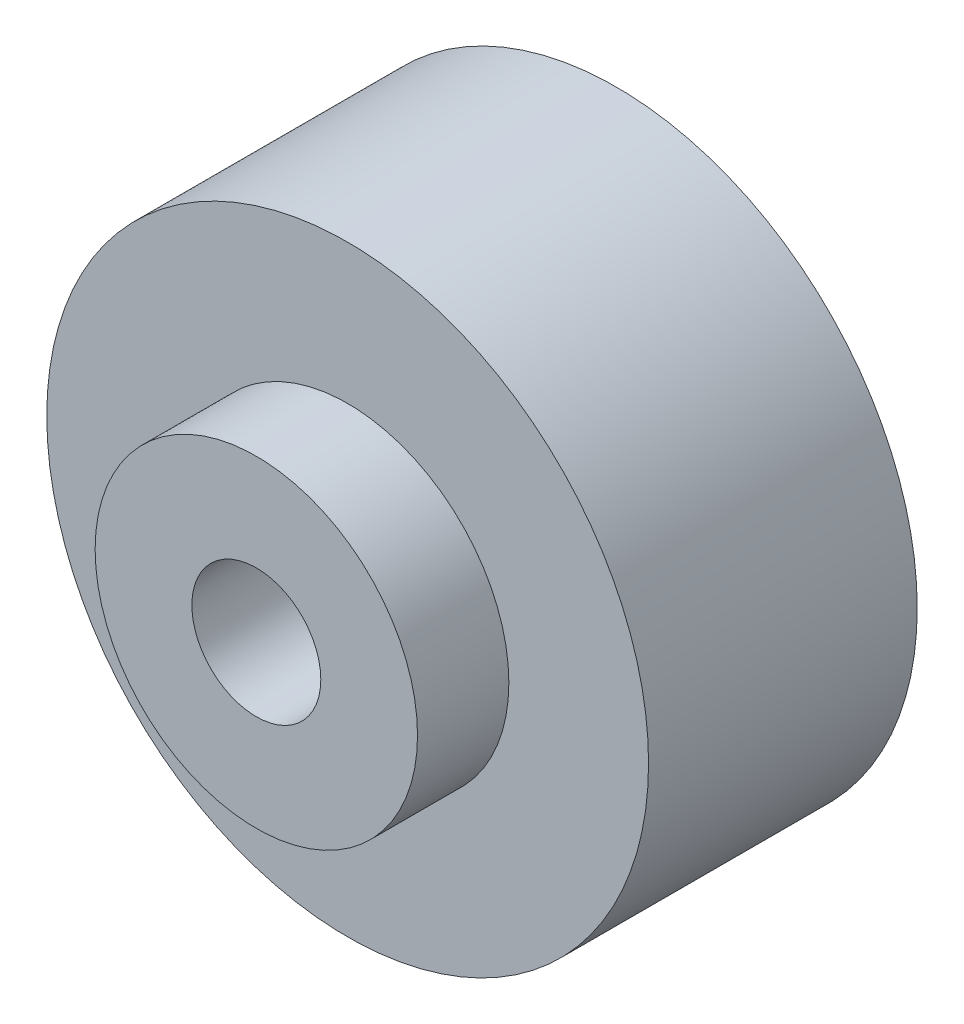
ISO-10303-21;
HEADER;
FILE_DESCRIPTION(('STEP AP214'),'2;1');
FILE_NAME('part.step','',(''),(''),'','','');
FILE_SCHEMA(('AUTOMOTIVE_DESIGN { 1 0 10303 214 1 1 1 1 }'));
ENDSEC;
DATA;
#1=APPLICATION_CONTEXT('core data for automotive mechanical design processes');
#2=APPLICATION_PROTOCOL_DEFINITION('international standard','automotive_design',2000,#1);
#3=PRODUCT_CONTEXT('',#1,'mechanical');
#4=PRODUCT('Part','Part','',(#3));
#5=PRODUCT_RELATED_PRODUCT_CATEGORY('part','',(#4));
#6=PRODUCT_DEFINITION_FORMATION('','',#4);
#7=PRODUCT_DEFINITION_CONTEXT('part definition',#1,'design');
#8=PRODUCT_DEFINITION('design','',#6,#7);
#9=PRODUCT_DEFINITION_SHAPE('','',#8);
#10=(LENGTH_UNIT() NAMED_UNIT(*) SI_UNIT(.MILLI.,.METRE.));
#11=(NAMED_UNIT(*) PLANE_ANGLE_UNIT() SI_UNIT($,.RADIAN.));
#12=(NAMED_UNIT(*) SI_UNIT($,.STERADIAN.) SOLID_ANGLE_UNIT());
#13=UNCERTAINTY_MEASURE_WITH_UNIT(LENGTH_MEASURE(1.E-05),#10,'distance_accuracy_value','');
#14=(GEOMETRIC_REPRESENTATION_CONTEXT(3) GLOBAL_UNCERTAINTY_ASSIGNED_CONTEXT((#13)) GLOBAL_UNIT_ASSIGNED_CONTEXT((#10,
#11,#12)) REPRESENTATION_CONTEXT('',''));
#15=CARTESIAN_POINT('',(0.,0.,0.));
#16=DIRECTION('',(0.,0.,1.));
#17=DIRECTION('',(1.,0.,0.));
#18=AXIS2_PLACEMENT_3D('',#15,#16,#17);
#19=CARTESIAN_POINT('',(0.,0.,-25.));
#20=DIRECTION('',(0.,0.,1.));
#21=DIRECTION('',(1.,0.,0.));
#22=AXIS2_PLACEMENT_3D('',#19,#20,#21);
#23=CYLINDRICAL_SURFACE('',#22,28.);
#24=CARTESIAN_POINT('',(0.,0.,-25.));
#25=DIRECTION('',(0.,0.,1.));
#26=DIRECTION('',(1.,0.,0.));
#27=AXIS2_PLACEMENT_3D('',#24,#25,#26);
#28=CIRCLE('',#27,28.);
#29=CARTESIAN_POINT('',(28.,0.,-25.));
#30=VERTEX_POINT('',#29);
#31=EDGE_CURVE('E58',#30,#30,#28,.T.);
#32=ORIENTED_EDGE('',*,*,#31,.T.);
#33=EDGE_LOOP('',(#32));
#34=FACE_BOUND('',#33,.T.);
#35=CARTESIAN_POINT('',(0.,0.,0.));
#36=DIRECTION('',(0.,0.,1.));
#37=DIRECTION('',(1.,0.,0.));
#38=AXIS2_PLACEMENT_3D('',#35,#36,#37);
#39=CIRCLE('',#38,28.);
#40=CARTESIAN_POINT('',(28.,0.,0.));
#41=VERTEX_POINT('',#40);
#42=EDGE_CURVE('E64',#41,#41,#39,.T.);
#43=ORIENTED_EDGE('',*,*,#42,.F.);
#44=EDGE_LOOP('',(#43));
#45=FACE_BOUND('',#44,.T.);
#46=ADVANCED_FACE('F51',(#34,#45),#23,.T.);
#47=CARTESIAN_POINT('',(0.,0.,-25.));
#48=DIRECTION('',(0.,0.,1.));
#49=DIRECTION('',(1.,0.,0.));
#50=AXIS2_PLACEMENT_3D('',#47,#48,#49);
#51=CYLINDRICAL_SURFACE('',#50,6.);
#52=CARTESIAN_POINT('',(0.,0.,-25.));
#53=DIRECTION('',(0.,0.,1.));
#54=DIRECTION('',(1.,0.,0.));
#55=AXIS2_PLACEMENT_3D('',#52,#53,#54);
#56=CIRCLE('',#55,6.);
#57=CARTESIAN_POINT('',(6.,0.,-25.));
#58=VERTEX_POINT('',#57);
#59=EDGE_CURVE('E11',#58,#58,#56,.T.);
#60=ORIENTED_EDGE('',*,*,#59,.F.);
#61=EDGE_LOOP('',(#60));
#62=FACE_BOUND('',#61,.T.);
#63=CARTESIAN_POINT('',(0.,0.,0.));
#64=DIRECTION('',(0.,0.,1.));
#65=DIRECTION('',(1.,0.,0.));
#66=AXIS2_PLACEMENT_3D('',#63,#64,#65);
#67=CIRCLE('',#66,6.);
#68=CARTESIAN_POINT('',(6.,0.,0.));
#69=VERTEX_POINT('',#68);
#70=EDGE_CURVE('E54',#69,#69,#67,.T.);
#71=ORIENTED_EDGE('',*,*,#70,.T.);
#72=EDGE_LOOP('',(#71));
#73=FACE_BOUND('',#72,.T.);
#74=ADVANCED_FACE('F71',(#62,#73),#51,.F.);
#75=CARTESIAN_POINT('',(0.,0.,-25.));
#76=DIRECTION('',(0.,0.,1.));
#77=DIRECTION('',(1.,0.,0.));
#78=AXIS2_PLACEMENT_3D('',#75,#76,#77);
#79=PLANE('',#78);
#80=ORIENTED_EDGE('',*,*,#31,.F.);
#81=EDGE_LOOP('',(#80));
#82=FACE_BOUND('',#81,.T.);
#83=ORIENTED_EDGE('',*,*,#59,.T.);
#84=EDGE_LOOP('',(#83));
#85=FACE_BOUND('',#84,.T.);
#86=ADVANCED_FACE('F75',(#82,#85),#79,.F.);
#87=CARTESIAN_POINT('',(0.,0.,0.));
#88=DIRECTION('',(0.,0.,1.));
#89=DIRECTION('',(1.,0.,0.));
#90=AXIS2_PLACEMENT_3D('',#87,#88,#89);
#91=PLANE('',#90);
#92=ORIENTED_EDGE('',*,*,#42,.T.);
#93=EDGE_LOOP('',(#92));
#94=FACE_BOUND('',#93,.T.);
#95=ORIENTED_EDGE('',*,*,#70,.F.);
#96=EDGE_LOOP('',(#95));
#97=FACE_BOUND('',#96,.T.);
#98=ADVANCED_FACE('F73',(#94,#97),#91,.T.);
#99=CLOSED_SHELL('',(#46,#74,#86,#98));
#100=MANIFOLD_SOLID_BREP('B2',#99);
#101=CARTESIAN_POINT('',(0.,0.,8.5));
#102=DIRECTION('',(0.,0.,-1.));
#103=DIRECTION('',(-1.,0.,0.));
#104=AXIS2_PLACEMENT_3D('',#101,#102,#103);
#105=CYLINDRICAL_SURFACE('',#104,6.);
#106=CARTESIAN_POINT('',(0.,0.,8.5));
#107=DIRECTION('',(0.,0.,1.));
#108=DIRECTION('',(1.,0.,0.));
#109=AXIS2_PLACEMENT_3D('',#106,#107,#108);
#110=CIRCLE('',#109,6.);
#111=CARTESIAN_POINT('',(6.,0.,8.5));
#112=VERTEX_POINT('',#111);
#113=EDGE_CURVE('E128',#112,#112,#110,.T.);
#114=ORIENTED_EDGE('',*,*,#113,.T.);
#115=EDGE_LOOP('',(#114));
#116=FACE_BOUND('',#115,.T.);
#117=CARTESIAN_POINT('',(0.,0.,0.));
#118=DIRECTION('',(0.,0.,1.));
#119=DIRECTION('',(1.,0.,0.));
#120=AXIS2_PLACEMENT_3D('',#117,#118,#119);
#121=CIRCLE('',#120,6.);
#122=CARTESIAN_POINT('',(6.,0.,0.));
#123=VERTEX_POINT('',#122);
#124=EDGE_CURVE('E134',#123,#123,#121,.T.);
#125=ORIENTED_EDGE('',*,*,#124,.F.);
#126=EDGE_LOOP('',(#125));
#127=FACE_BOUND('',#126,.T.);
#128=ADVANCED_FACE('F121',(#116,#127),#105,.F.);
#129=CARTESIAN_POINT('',(0.,0.,8.5));
#130=DIRECTION('',(0.,0.,-1.));
#131=DIRECTION('',(-1.,0.,0.));
#132=AXIS2_PLACEMENT_3D('',#129,#130,#131);
#133=CYLINDRICAL_SURFACE('',#132,15.);
#134=CARTESIAN_POINT('',(0.,0.,8.5));
#135=DIRECTION('',(0.,0.,1.));
#136=DIRECTION('',(1.,0.,0.));
#137=AXIS2_PLACEMENT_3D('',#134,#135,#136);
#138=CIRCLE('',#137,15.);
#139=CARTESIAN_POINT('',(15.,0.,8.5));
#140=VERTEX_POINT('',#139);
#141=EDGE_CURVE('E50',#140,#140,#138,.T.);
#142=ORIENTED_EDGE('',*,*,#141,.F.);
#143=EDGE_LOOP('',(#142));
#144=FACE_BOUND('',#143,.T.);
#145=CARTESIAN_POINT('',(0.,0.,0.));
#146=DIRECTION('',(0.,0.,1.));
#147=DIRECTION('',(1.,0.,0.));
#148=AXIS2_PLACEMENT_3D('',#145,#146,#147);
#149=CIRCLE('',#148,15.);
#150=CARTESIAN_POINT('',(15.,0.,0.));
#151=VERTEX_POINT('',#150);
#152=EDGE_CURVE('E124',#151,#151,#149,.T.);
#153=ORIENTED_EDGE('',*,*,#152,.T.);
#154=EDGE_LOOP('',(#153));
#155=FACE_BOUND('',#154,.T.);
#156=ADVANCED_FACE('F141',(#144,#155),#133,.T.);
#157=CARTESIAN_POINT('',(0.,0.,8.5));
#158=DIRECTION('',(0.,0.,1.));
#159=DIRECTION('',(1.,0.,0.));
#160=AXIS2_PLACEMENT_3D('',#157,#158,#159);
#161=PLANE('',#160);
#162=ORIENTED_EDGE('',*,*,#113,.F.);
#163=EDGE_LOOP('',(#162));
#164=FACE_BOUND('',#163,.T.);
#165=ORIENTED_EDGE('',*,*,#141,.T.);
#166=EDGE_LOOP('',(#165));
#167=FACE_BOUND('',#166,.T.);
#168=ADVANCED_FACE('F145',(#164,#167),#161,.T.);
#169=CARTESIAN_POINT('',(0.,0.,0.));
#170=DIRECTION('',(0.,0.,1.));
#171=DIRECTION('',(1.,0.,0.));
#172=AXIS2_PLACEMENT_3D('',#169,#170,#171);
#173=PLANE('',#172);
#174=ORIENTED_EDGE('',*,*,#124,.T.);
#175=EDGE_LOOP('',(#174));
#176=FACE_BOUND('',#175,.T.);
#177=ORIENTED_EDGE('',*,*,#152,.F.);
#178=EDGE_LOOP('',(#177));
#179=FACE_BOUND('',#178,.T.);
#180=ADVANCED_FACE('F143',(#176,#179),#173,.F.);
#181=CLOSED_SHELL('',(#128,#156,#168,#180));
#182=MANIFOLD_SOLID_BREP('B6',#181);
#183=ADVANCED_BREP_SHAPE_REPRESENTATION('',(#18,#100,#182),#14);
#184=SHAPE_DEFINITION_REPRESENTATION(#9,#183);
ENDSEC;
END-ISO-10303-21;
